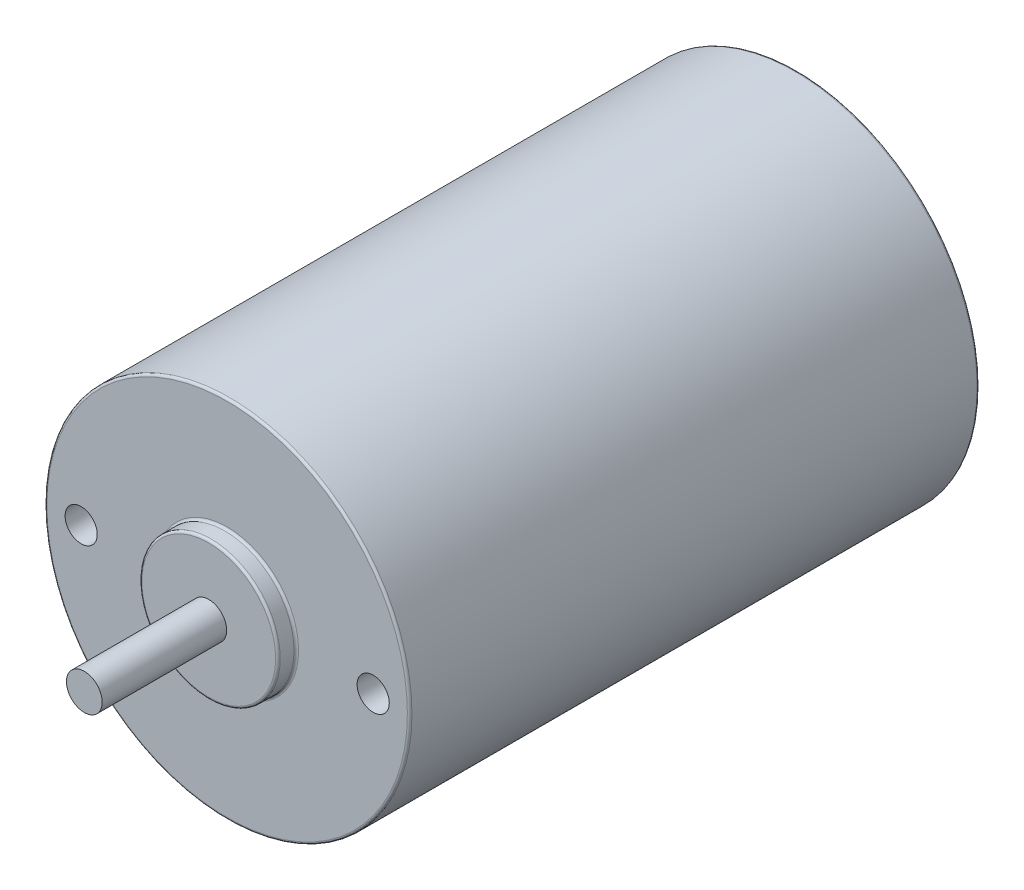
from build123d import *

# Parameters (mm, degrees)
SKETCH4_R             = 1.555
SHAFT_DEPTH           = 37.2
FILLET1_R             = 0.2
SKETCH6_R             = 1.4
F_6_32_THREADED_DEPTH = 5


with BuildPart() as part:
    # Sketch2 → body (revolve)
    with BuildSketch(Plane(origin=(0, 0, 0), x_dir=(1, 0, 0), z_dir=(0, 1, 0))):
        Polygon((1.55, -26.375), (1.55, 26.375), (6.015, 26.375), (6.015, 24.775), (15.875, 24.775), (15.875, -24.775), (6.015, -24.775), (6.015, -26.375), align=None)
    revolve(axis=Axis((0, 0, 0), (0, 0, -1)))

    # Sketch4 → shaft (add)
    with BuildSketch(Plane.XY):
        Circle(SKETCH4_R)
    extrude(amount=SHAFT_DEPTH)

    # Fillet1
    fillet1_edges = [part.edges().sort_by_distance(p)[0] for p in [
        (-6.015, 0, 26.375),
        (-6.015, 0, 24.775),
        (-15.875, 0, 24.775),
        (-15.875, 0, -24.775),
        (-6.015, 0, -24.775),
        (-6.015, 0, -26.375),
    ]]
    fillet(fillet1_edges, radius=FILLET1_R)

    # Sketch6 → 6-32 threaded (cut)
    with BuildSketch(Plane.XY.offset(24.775)):
        with Locations((-12.7, 0)):
            Circle(SKETCH6_R)
        with Locations((12.7, 0)):
            Circle(SKETCH6_R)
    extrude(amount=-F_6_32_THREADED_DEPTH, mode=Mode.SUBTRACT)


solid = part.part
